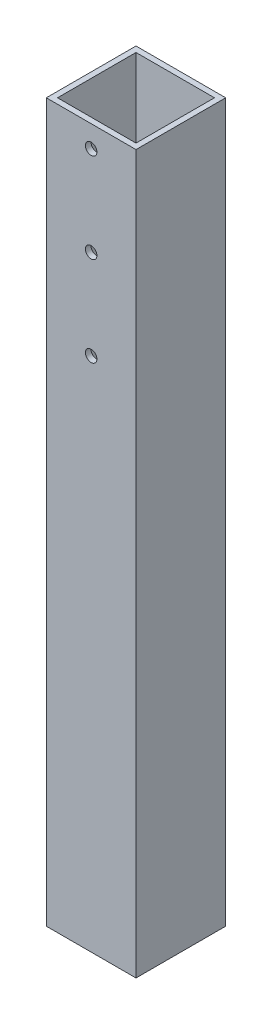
ISO-10303-21;
HEADER;
FILE_DESCRIPTION(('STEP AP214'),'2;1');
FILE_NAME('part.step','',(''),(''),'','','');
FILE_SCHEMA(('AUTOMOTIVE_DESIGN { 1 0 10303 214 1 1 1 1 }'));
ENDSEC;
DATA;
#1=APPLICATION_CONTEXT('core data for automotive mechanical design processes');
#2=APPLICATION_PROTOCOL_DEFINITION('international standard','automotive_design',2000,#1);
#3=PRODUCT_CONTEXT('',#1,'mechanical');
#4=PRODUCT('Part','Part','',(#3));
#5=PRODUCT_RELATED_PRODUCT_CATEGORY('part','',(#4));
#6=PRODUCT_DEFINITION_FORMATION('','',#4);
#7=PRODUCT_DEFINITION_CONTEXT('part definition',#1,'design');
#8=PRODUCT_DEFINITION('design','',#6,#7);
#9=PRODUCT_DEFINITION_SHAPE('','',#8);
#10=(LENGTH_UNIT() NAMED_UNIT(*) SI_UNIT(.MILLI.,.METRE.));
#11=(NAMED_UNIT(*) PLANE_ANGLE_UNIT() SI_UNIT($,.RADIAN.));
#12=(NAMED_UNIT(*) SI_UNIT($,.STERADIAN.) SOLID_ANGLE_UNIT());
#13=UNCERTAINTY_MEASURE_WITH_UNIT(LENGTH_MEASURE(1.E-05),#10,'distance_accuracy_value','');
#14=(GEOMETRIC_REPRESENTATION_CONTEXT(3) GLOBAL_UNCERTAINTY_ASSIGNED_CONTEXT((#13)) GLOBAL_UNIT_ASSIGNED_CONTEXT((#10,
#11,#12)) REPRESENTATION_CONTEXT('',''));
#15=CARTESIAN_POINT('',(0.,0.,0.));
#16=DIRECTION('',(0.,0.,1.));
#17=DIRECTION('',(1.,0.,0.));
#18=AXIS2_PLACEMENT_3D('',#15,#16,#17);
#19=CARTESIAN_POINT('',(0.,203.2,0.));
#20=DIRECTION('',(0.,-1.,0.));
#21=DIRECTION('',(0.,0.,1.));
#22=AXIS2_PLACEMENT_3D('',#19,#20,#21);
#23=PLANE('',#22);
#24=DIRECTION('',(0.,0.,1.));
#25=VECTOR('',#24,1.);
#26=CARTESIAN_POINT('',(12.7,203.2,-12.7));
#27=LINE('',#26,#25);
#28=CARTESIAN_POINT('',(12.7,203.2,-12.7));
#29=VERTEX_POINT('',#28);
#30=CARTESIAN_POINT('',(12.7,203.2,12.7));
#31=VERTEX_POINT('',#30);
#32=EDGE_CURVE('E140',#29,#31,#27,.T.);
#33=ORIENTED_EDGE('',*,*,#32,.F.);
#34=DIRECTION('',(1.,0.,0.));
#35=VECTOR('',#34,1.);
#36=CARTESIAN_POINT('',(-12.7,203.2,-12.7));
#37=LINE('',#36,#35);
#38=CARTESIAN_POINT('',(-12.7,203.2,-12.7));
#39=VERTEX_POINT('',#38);
#40=EDGE_CURVE('E150',#39,#29,#37,.T.);
#41=ORIENTED_EDGE('',*,*,#40,.F.);
#42=DIRECTION('',(0.,0.,-1.));
#43=VECTOR('',#42,1.);
#44=CARTESIAN_POINT('',(-12.7,203.2,-12.7));
#45=LINE('',#44,#43);
#46=CARTESIAN_POINT('',(-12.7,203.2,12.7));
#47=VERTEX_POINT('',#46);
#48=EDGE_CURVE('E147',#47,#39,#45,.T.);
#49=ORIENTED_EDGE('',*,*,#48,.F.);
#50=DIRECTION('',(-1.,0.,0.));
#51=VECTOR('',#50,1.);
#52=CARTESIAN_POINT('',(-12.7,203.2,12.7));
#53=LINE('',#52,#51);
#54=EDGE_CURVE('E143',#31,#47,#53,.T.);
#55=ORIENTED_EDGE('',*,*,#54,.F.);
#56=EDGE_LOOP('',(#33,#41,#49,#55));
#57=FACE_BOUND('',#56,.T.);
#58=DIRECTION('',(0.,0.,1.));
#59=VECTOR('',#58,1.);
#60=CARTESIAN_POINT('',(11.1125,203.2,-11.1125));
#61=LINE('',#60,#59);
#62=CARTESIAN_POINT('',(11.1125,203.2,-11.1125));
#63=VERTEX_POINT('',#62);
#64=CARTESIAN_POINT('',(11.1125,203.2,11.1125));
#65=VERTEX_POINT('',#64);
#66=EDGE_CURVE('E104',#63,#65,#61,.T.);
#67=ORIENTED_EDGE('',*,*,#66,.T.);
#68=DIRECTION('',(-1.,0.,0.));
#69=VECTOR('',#68,1.);
#70=CARTESIAN_POINT('',(-11.1125,203.2,11.1125));
#71=LINE('',#70,#69);
#72=CARTESIAN_POINT('',(-11.1125,203.2,11.1125));
#73=VERTEX_POINT('',#72);
#74=EDGE_CURVE('E113',#65,#73,#71,.T.);
#75=ORIENTED_EDGE('',*,*,#74,.T.);
#76=DIRECTION('',(0.,0.,-1.));
#77=VECTOR('',#76,1.);
#78=CARTESIAN_POINT('',(-11.1125,203.2,-11.1125));
#79=LINE('',#78,#77);
#80=CARTESIAN_POINT('',(-11.1125,203.2,-11.1125));
#81=VERTEX_POINT('',#80);
#82=EDGE_CURVE('E117',#73,#81,#79,.T.);
#83=ORIENTED_EDGE('',*,*,#82,.T.);
#84=DIRECTION('',(1.,0.,0.));
#85=VECTOR('',#84,1.);
#86=CARTESIAN_POINT('',(-11.1125,203.2,-11.1125));
#87=LINE('',#86,#85);
#88=EDGE_CURVE('E120',#81,#63,#87,.T.);
#89=ORIENTED_EDGE('',*,*,#88,.T.);
#90=EDGE_LOOP('',(#67,#75,#83,#89));
#91=FACE_BOUND('',#90,.T.);
#92=ADVANCED_FACE('F37',(#57,#91),#23,.F.);
#93=CARTESIAN_POINT('',(0.,0.,0.));
#94=DIRECTION('',(0.,-1.,0.));
#95=DIRECTION('',(0.,0.,1.));
#96=AXIS2_PLACEMENT_3D('',#93,#94,#95);
#97=PLANE('',#96);
#98=DIRECTION('',(0.,0.,1.));
#99=VECTOR('',#98,1.);
#100=CARTESIAN_POINT('',(12.7,0.,-12.7));
#101=LINE('',#100,#99);
#102=CARTESIAN_POINT('',(12.7,0.,-12.7));
#103=VERTEX_POINT('',#102);
#104=CARTESIAN_POINT('',(12.7,0.,12.7));
#105=VERTEX_POINT('',#104);
#106=EDGE_CURVE('E109',#103,#105,#101,.T.);
#107=ORIENTED_EDGE('',*,*,#106,.T.);
#108=DIRECTION('',(-1.,0.,0.));
#109=VECTOR('',#108,1.);
#110=CARTESIAN_POINT('',(-12.7,0.,12.7));
#111=LINE('',#110,#109);
#112=CARTESIAN_POINT('',(-12.7,0.,12.7));
#113=VERTEX_POINT('',#112);
#114=EDGE_CURVE('E156',#105,#113,#111,.T.);
#115=ORIENTED_EDGE('',*,*,#114,.T.);
#116=DIRECTION('',(0.,0.,-1.));
#117=VECTOR('',#116,1.);
#118=CARTESIAN_POINT('',(-12.7,0.,-12.7));
#119=LINE('',#118,#117);
#120=CARTESIAN_POINT('',(-12.7,0.,-12.7));
#121=VERTEX_POINT('',#120);
#122=EDGE_CURVE('E159',#113,#121,#119,.T.);
#123=ORIENTED_EDGE('',*,*,#122,.T.);
#124=DIRECTION('',(1.,0.,0.));
#125=VECTOR('',#124,1.);
#126=CARTESIAN_POINT('',(-12.7,0.,-12.7));
#127=LINE('',#126,#125);
#128=EDGE_CURVE('E144',#121,#103,#127,.T.);
#129=ORIENTED_EDGE('',*,*,#128,.T.);
#130=EDGE_LOOP('',(#107,#115,#123,#129));
#131=FACE_BOUND('',#130,.T.);
#132=DIRECTION('',(1.,0.,0.));
#133=VECTOR('',#132,1.);
#134=CARTESIAN_POINT('',(-11.1125,0.,-11.1125));
#135=LINE('',#134,#133);
#136=CARTESIAN_POINT('',(-11.1125,0.,-11.1125));
#137=VERTEX_POINT('',#136);
#138=CARTESIAN_POINT('',(11.1125,0.,-11.1125));
#139=VERTEX_POINT('',#138);
#140=EDGE_CURVE('E121',#137,#139,#135,.T.);
#141=ORIENTED_EDGE('',*,*,#140,.F.);
#142=DIRECTION('',(0.,0.,-1.));
#143=VECTOR('',#142,1.);
#144=CARTESIAN_POINT('',(-11.1125,0.,-11.1125));
#145=LINE('',#144,#143);
#146=CARTESIAN_POINT('',(-11.1125,0.,11.1125));
#147=VERTEX_POINT('',#146);
#148=EDGE_CURVE('E124',#147,#137,#145,.T.);
#149=ORIENTED_EDGE('',*,*,#148,.F.);
#150=DIRECTION('',(-1.,0.,0.));
#151=VECTOR('',#150,1.);
#152=CARTESIAN_POINT('',(-11.1125,0.,11.1125));
#153=LINE('',#152,#151);
#154=CARTESIAN_POINT('',(11.1125,0.,11.1125));
#155=VERTEX_POINT('',#154);
#156=EDGE_CURVE('E133',#155,#147,#153,.T.);
#157=ORIENTED_EDGE('',*,*,#156,.F.);
#158=DIRECTION('',(0.,0.,1.));
#159=VECTOR('',#158,1.);
#160=CARTESIAN_POINT('',(11.1125,0.,-11.1125));
#161=LINE('',#160,#159);
#162=EDGE_CURVE('E105',#139,#155,#161,.T.);
#163=ORIENTED_EDGE('',*,*,#162,.F.);
#164=EDGE_LOOP('',(#141,#149,#157,#163));
#165=FACE_BOUND('',#164,.T.);
#166=ADVANCED_FACE('F176',(#131,#165),#97,.T.);
#167=CARTESIAN_POINT('',(12.7,203.2,-12.7));
#168=DIRECTION('',(-1.,0.,0.));
#169=DIRECTION('',(0.,0.,-1.));
#170=AXIS2_PLACEMENT_3D('',#167,#168,#169);
#171=PLANE('',#170);
#172=ORIENTED_EDGE('',*,*,#106,.F.);
#173=DIRECTION('',(0.,-1.,0.));
#174=VECTOR('',#173,1.);
#175=CARTESIAN_POINT('',(12.7,203.2,-12.7));
#176=LINE('',#175,#174);
#177=EDGE_CURVE('E153',#29,#103,#176,.T.);
#178=ORIENTED_EDGE('',*,*,#177,.F.);
#179=ORIENTED_EDGE('',*,*,#32,.T.);
#180=DIRECTION('',(0.,-1.,0.));
#181=VECTOR('',#180,1.);
#182=CARTESIAN_POINT('',(12.7,203.2,12.7));
#183=LINE('',#182,#181);
#184=EDGE_CURVE('E11',#31,#105,#183,.T.);
#185=ORIENTED_EDGE('',*,*,#184,.T.);
#186=EDGE_LOOP('',(#172,#178,#179,#185));
#187=FACE_BOUND('',#186,.T.);
#188=ADVANCED_FACE('F39',(#187),#171,.F.);
#189=CARTESIAN_POINT('',(-12.7,203.2,12.7));
#190=DIRECTION('',(0.,0.,-1.));
#191=DIRECTION('',(1.,0.,0.));
#192=AXIS2_PLACEMENT_3D('',#189,#190,#191);
#193=PLANE('',#192);
#194=CARTESIAN_POINT('',(-2.02669101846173E-13,146.247703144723,12.7));
#195=DIRECTION('',(0.,0.,-1.));
#196=DIRECTION('',(-1.,0.,0.));
#197=AXIS2_PLACEMENT_3D('',#194,#195,#196);
#198=CIRCLE('',#197,1.63195);
#199=CARTESIAN_POINT('',(-1.6319500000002,146.247703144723,12.7));
#200=VERTEX_POINT('',#199);
#201=EDGE_CURVE('E226',#200,#200,#198,.T.);
#202=ORIENTED_EDGE('',*,*,#201,.T.);
#203=EDGE_LOOP('',(#202));
#204=FACE_BOUND('',#203,.T.);
#205=CARTESIAN_POINT('',(-1.94289029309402E-13,171.647703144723,12.7));
#206=DIRECTION('',(0.,0.,-1.));
#207=DIRECTION('',(-1.,0.,0.));
#208=AXIS2_PLACEMENT_3D('',#205,#206,#207);
#209=CIRCLE('',#208,1.63195);
#210=CARTESIAN_POINT('',(-1.63195000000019,171.647703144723,12.7));
#211=VERTEX_POINT('',#210);
#212=EDGE_CURVE('E233',#211,#211,#209,.T.);
#213=ORIENTED_EDGE('',*,*,#212,.T.);
#214=EDGE_LOOP('',(#213));
#215=FACE_BOUND('',#214,.T.);
#216=CARTESIAN_POINT('',(-1.921301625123E-13,197.047703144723,12.7));
#217=DIRECTION('',(0.,0.,-1.));
#218=DIRECTION('',(-1.,0.,0.));
#219=AXIS2_PLACEMENT_3D('',#216,#217,#218);
#220=CIRCLE('',#219,1.63195);
#221=CARTESIAN_POINT('',(-1.63195000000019,197.047703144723,12.7));
#222=VERTEX_POINT('',#221);
#223=EDGE_CURVE('E237',#222,#222,#220,.T.);
#224=ORIENTED_EDGE('',*,*,#223,.T.);
#225=EDGE_LOOP('',(#224));
#226=FACE_BOUND('',#225,.T.);
#227=ORIENTED_EDGE('',*,*,#114,.F.);
#228=ORIENTED_EDGE('',*,*,#184,.F.);
#229=ORIENTED_EDGE('',*,*,#54,.T.);
#230=DIRECTION('',(0.,-1.,0.));
#231=VECTOR('',#230,1.);
#232=CARTESIAN_POINT('',(-12.7,203.2,12.7));
#233=LINE('',#232,#231);
#234=EDGE_CURVE('E45',#47,#113,#233,.T.);
#235=ORIENTED_EDGE('',*,*,#234,.T.);
#236=EDGE_LOOP('',(#227,#228,#229,#235));
#237=FACE_BOUND('',#236,.T.);
#238=ADVANCED_FACE('F169',(#204,#215,#226,#237),#193,.F.);
#239=CARTESIAN_POINT('',(-12.7,203.2,-12.7));
#240=DIRECTION('',(1.,0.,0.));
#241=DIRECTION('',(0.,0.,1.));
#242=AXIS2_PLACEMENT_3D('',#239,#240,#241);
#243=PLANE('',#242);
#244=ORIENTED_EDGE('',*,*,#122,.F.);
#245=ORIENTED_EDGE('',*,*,#234,.F.);
#246=ORIENTED_EDGE('',*,*,#48,.T.);
#247=DIRECTION('',(0.,-1.,0.));
#248=VECTOR('',#247,1.);
#249=CARTESIAN_POINT('',(-12.7,203.2,-12.7));
#250=LINE('',#249,#248);
#251=EDGE_CURVE('E165',#39,#121,#250,.T.);
#252=ORIENTED_EDGE('',*,*,#251,.T.);
#253=EDGE_LOOP('',(#244,#245,#246,#252));
#254=FACE_BOUND('',#253,.T.);
#255=ADVANCED_FACE('F173',(#254),#243,.F.);
#256=CARTESIAN_POINT('',(-12.7,203.2,-12.7));
#257=DIRECTION('',(0.,0.,1.));
#258=DIRECTION('',(-1.,0.,0.));
#259=AXIS2_PLACEMENT_3D('',#256,#257,#258);
#260=PLANE('',#259);
#261=ORIENTED_EDGE('',*,*,#128,.F.);
#262=ORIENTED_EDGE('',*,*,#251,.F.);
#263=ORIENTED_EDGE('',*,*,#40,.T.);
#264=ORIENTED_EDGE('',*,*,#177,.T.);
#265=EDGE_LOOP('',(#261,#262,#263,#264));
#266=FACE_BOUND('',#265,.T.);
#267=ADVANCED_FACE('F184',(#266),#260,.F.);
#268=CARTESIAN_POINT('',(11.1125,203.2,-11.1125));
#269=DIRECTION('',(-1.,0.,0.));
#270=DIRECTION('',(0.,0.,-1.));
#271=AXIS2_PLACEMENT_3D('',#268,#269,#270);
#272=PLANE('',#271);
#273=ORIENTED_EDGE('',*,*,#162,.T.);
#274=DIRECTION('',(0.,-1.,0.));
#275=VECTOR('',#274,1.);
#276=CARTESIAN_POINT('',(11.1125,203.2,11.1125));
#277=LINE('',#276,#275);
#278=EDGE_CURVE('E100',#65,#155,#277,.T.);
#279=ORIENTED_EDGE('',*,*,#278,.F.);
#280=ORIENTED_EDGE('',*,*,#66,.F.);
#281=DIRECTION('',(0.,-1.,0.));
#282=VECTOR('',#281,1.);
#283=CARTESIAN_POINT('',(11.1125,203.2,-11.1125));
#284=LINE('',#283,#282);
#285=EDGE_CURVE('E60',#63,#139,#284,.T.);
#286=ORIENTED_EDGE('',*,*,#285,.T.);
#287=EDGE_LOOP('',(#273,#279,#280,#286));
#288=FACE_BOUND('',#287,.T.);
#289=ADVANCED_FACE('F102',(#288),#272,.T.);
#290=CARTESIAN_POINT('',(-11.1125,203.2,11.1125));
#291=DIRECTION('',(0.,0.,-1.));
#292=DIRECTION('',(1.,0.,0.));
#293=AXIS2_PLACEMENT_3D('',#290,#291,#292);
#294=PLANE('',#293);
#295=CARTESIAN_POINT('',(-2.02669101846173E-13,146.247703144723,11.1125));
#296=DIRECTION('',(0.,0.,1.));
#297=DIRECTION('',(1.,0.,0.));
#298=AXIS2_PLACEMENT_3D('',#295,#296,#297);
#299=CIRCLE('',#298,1.63195);
#300=CARTESIAN_POINT('',(1.63194999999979,146.247703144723,11.1125));
#301=VERTEX_POINT('',#300);
#302=EDGE_CURVE('E134',#301,#301,#299,.F.);
#303=ORIENTED_EDGE('',*,*,#302,.F.);
#304=EDGE_LOOP('',(#303));
#305=FACE_BOUND('',#304,.T.);
#306=CARTESIAN_POINT('',(-1.94289029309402E-13,171.647703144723,11.1125));
#307=DIRECTION('',(0.,0.,1.));
#308=DIRECTION('',(1.,0.,0.));
#309=AXIS2_PLACEMENT_3D('',#306,#307,#308);
#310=CIRCLE('',#309,1.63195);
#311=CARTESIAN_POINT('',(1.6319499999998,171.647703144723,11.1125));
#312=VERTEX_POINT('',#311);
#313=EDGE_CURVE('E230',#312,#312,#310,.F.);
#314=ORIENTED_EDGE('',*,*,#313,.F.);
#315=EDGE_LOOP('',(#314));
#316=FACE_BOUND('',#315,.T.);
#317=CARTESIAN_POINT('',(-1.921301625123E-13,197.047703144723,11.1125));
#318=DIRECTION('',(0.,0.,1.));
#319=DIRECTION('',(1.,0.,0.));
#320=AXIS2_PLACEMENT_3D('',#317,#318,#319);
#321=CIRCLE('',#320,1.63195);
#322=CARTESIAN_POINT('',(1.63194999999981,197.047703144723,11.1125));
#323=VERTEX_POINT('',#322);
#324=EDGE_CURVE('E127',#323,#323,#321,.F.);
#325=ORIENTED_EDGE('',*,*,#324,.F.);
#326=EDGE_LOOP('',(#325));
#327=FACE_BOUND('',#326,.T.);
#328=ORIENTED_EDGE('',*,*,#156,.T.);
#329=DIRECTION('',(0.,-1.,0.));
#330=VECTOR('',#329,1.);
#331=CARTESIAN_POINT('',(-11.1125,203.2,11.1125));
#332=LINE('',#331,#330);
#333=EDGE_CURVE('E110',#73,#147,#332,.T.);
#334=ORIENTED_EDGE('',*,*,#333,.F.);
#335=ORIENTED_EDGE('',*,*,#74,.F.);
#336=ORIENTED_EDGE('',*,*,#278,.T.);
#337=EDGE_LOOP('',(#328,#334,#335,#336));
#338=FACE_BOUND('',#337,.T.);
#339=ADVANCED_FACE('F114',(#305,#316,#327,#338),#294,.T.);
#340=CARTESIAN_POINT('',(-11.1125,203.2,-11.1125));
#341=DIRECTION('',(1.,0.,0.));
#342=DIRECTION('',(0.,0.,1.));
#343=AXIS2_PLACEMENT_3D('',#340,#341,#342);
#344=PLANE('',#343);
#345=ORIENTED_EDGE('',*,*,#148,.T.);
#346=DIRECTION('',(0.,-1.,0.));
#347=VECTOR('',#346,1.);
#348=CARTESIAN_POINT('',(-11.1125,203.2,-11.1125));
#349=LINE('',#348,#347);
#350=EDGE_CURVE('E52',#81,#137,#349,.T.);
#351=ORIENTED_EDGE('',*,*,#350,.F.);
#352=ORIENTED_EDGE('',*,*,#82,.F.);
#353=ORIENTED_EDGE('',*,*,#333,.T.);
#354=EDGE_LOOP('',(#345,#351,#352,#353));
#355=FACE_BOUND('',#354,.T.);
#356=ADVANCED_FACE('F202',(#355),#344,.T.);
#357=CARTESIAN_POINT('',(-11.1125,203.2,-11.1125));
#358=DIRECTION('',(0.,0.,1.));
#359=DIRECTION('',(-1.,0.,0.));
#360=AXIS2_PLACEMENT_3D('',#357,#358,#359);
#361=PLANE('',#360);
#362=ORIENTED_EDGE('',*,*,#140,.T.);
#363=ORIENTED_EDGE('',*,*,#285,.F.);
#364=ORIENTED_EDGE('',*,*,#88,.F.);
#365=ORIENTED_EDGE('',*,*,#350,.T.);
#366=EDGE_LOOP('',(#362,#363,#364,#365));
#367=FACE_BOUND('',#366,.T.);
#368=ADVANCED_FACE('F206',(#367),#361,.T.);
#369=CARTESIAN_POINT('',(-1.921301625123E-13,197.047703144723,6.49664835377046));
#370=DIRECTION('',(0.,0.,1.));
#371=DIRECTION('',(-1.,0.,0.));
#372=AXIS2_PLACEMENT_3D('',#369,#370,#371);
#373=CYLINDRICAL_SURFACE('',#372,1.63195);
#374=ORIENTED_EDGE('',*,*,#223,.F.);
#375=EDGE_LOOP('',(#374));
#376=FACE_BOUND('',#375,.T.);
#377=ORIENTED_EDGE('',*,*,#324,.T.);
#378=EDGE_LOOP('',(#377));
#379=FACE_BOUND('',#378,.T.);
#380=ADVANCED_FACE('F209',(#376,#379),#373,.F.);
#381=CARTESIAN_POINT('',(-1.94289029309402E-13,171.647703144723,6.49664835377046));
#382=DIRECTION('',(0.,0.,1.));
#383=DIRECTION('',(-1.,0.,0.));
#384=AXIS2_PLACEMENT_3D('',#381,#382,#383);
#385=CYLINDRICAL_SURFACE('',#384,1.63195);
#386=ORIENTED_EDGE('',*,*,#212,.F.);
#387=EDGE_LOOP('',(#386));
#388=FACE_BOUND('',#387,.T.);
#389=ORIENTED_EDGE('',*,*,#313,.T.);
#390=EDGE_LOOP('',(#389));
#391=FACE_BOUND('',#390,.T.);
#392=ADVANCED_FACE('F213',(#388,#391),#385,.F.);
#393=CARTESIAN_POINT('',(-2.02669101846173E-13,146.247703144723,6.49664835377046));
#394=DIRECTION('',(0.,0.,1.));
#395=DIRECTION('',(-1.,0.,0.));
#396=AXIS2_PLACEMENT_3D('',#393,#394,#395);
#397=CYLINDRICAL_SURFACE('',#396,1.63195);
#398=ORIENTED_EDGE('',*,*,#201,.F.);
#399=EDGE_LOOP('',(#398));
#400=FACE_BOUND('',#399,.T.);
#401=ORIENTED_EDGE('',*,*,#302,.T.);
#402=EDGE_LOOP('',(#401));
#403=FACE_BOUND('',#402,.T.);
#404=ADVANCED_FACE('F217',(#400,#403),#397,.F.);
#405=CLOSED_SHELL('',(#92,#166,#188,#238,#255,#267,#289,#339,#356,#368,#380,#392,#404));
#406=MANIFOLD_SOLID_BREP('B2',#405);
#407=ADVANCED_BREP_SHAPE_REPRESENTATION('',(#18,#406),#14);
#408=SHAPE_DEFINITION_REPRESENTATION(#9,#407);
ENDSEC;
END-ISO-10303-21;
